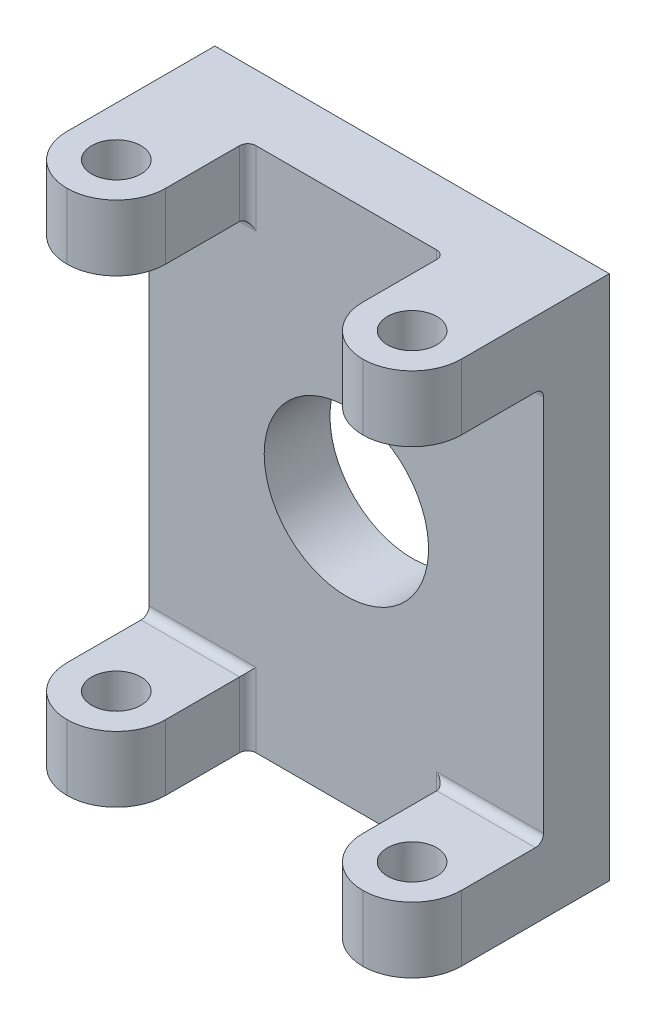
ISO-10303-21;
HEADER;
FILE_DESCRIPTION(('STEP AP214'),'2;1');
FILE_NAME('part.step','',(''),(''),'','','');
FILE_SCHEMA(('AUTOMOTIVE_DESIGN { 1 0 10303 214 1 1 1 1 }'));
ENDSEC;
DATA;
#1=APPLICATION_CONTEXT('core data for automotive mechanical design processes');
#2=APPLICATION_PROTOCOL_DEFINITION('international standard','automotive_design',2000,#1);
#3=PRODUCT_CONTEXT('',#1,'mechanical');
#4=PRODUCT('Part','Part','',(#3));
#5=PRODUCT_RELATED_PRODUCT_CATEGORY('part','',(#4));
#6=PRODUCT_DEFINITION_FORMATION('','',#4);
#7=PRODUCT_DEFINITION_CONTEXT('part definition',#1,'design');
#8=PRODUCT_DEFINITION('design','',#6,#7);
#9=PRODUCT_DEFINITION_SHAPE('','',#8);
#10=(LENGTH_UNIT() NAMED_UNIT(*) SI_UNIT(.MILLI.,.METRE.));
#11=(NAMED_UNIT(*) PLANE_ANGLE_UNIT() SI_UNIT($,.RADIAN.));
#12=(NAMED_UNIT(*) SI_UNIT($,.STERADIAN.) SOLID_ANGLE_UNIT());
#13=UNCERTAINTY_MEASURE_WITH_UNIT(LENGTH_MEASURE(1.E-05),#10,'distance_accuracy_value','');
#14=(GEOMETRIC_REPRESENTATION_CONTEXT(3) GLOBAL_UNCERTAINTY_ASSIGNED_CONTEXT((#13)) GLOBAL_UNIT_ASSIGNED_CONTEXT((#10,
#11,#12)) REPRESENTATION_CONTEXT('',''));
#15=CARTESIAN_POINT('',(0.,0.,0.));
#16=DIRECTION('',(0.,0.,1.));
#17=DIRECTION('',(1.,0.,0.));
#18=AXIS2_PLACEMENT_3D('',#15,#16,#17);
#19=CARTESIAN_POINT('',(-76.2,-101.6,25.4));
#20=DIRECTION('',(0.,0.,-1.));
#21=DIRECTION('',(-1.,0.,0.));
#22=AXIS2_PLACEMENT_3D('',#19,#20,#21);
#23=PLANE('',#22);
#24=CARTESIAN_POINT('',(0.,0.,25.4));
#25=DIRECTION('',(0.,0.,-1.));
#26=DIRECTION('',(-1.,0.,0.));
#27=AXIS2_PLACEMENT_3D('',#24,#25,#26);
#28=CIRCLE('',#27,31.75);
#29=CARTESIAN_POINT('',(-31.75,0.,25.4));
#30=VERTEX_POINT('',#29);
#31=EDGE_CURVE('E238',#30,#30,#28,.T.);
#32=ORIENTED_EDGE('',*,*,#31,.T.);
#33=EDGE_LOOP('',(#32));
#34=FACE_BOUND('',#33,.T.);
#35=DIRECTION('',(0.,1.,0.));
#36=VECTOR('',#35,1.);
#37=CARTESIAN_POINT('',(34.925,-101.6,25.4));
#38=LINE('',#37,#36);
#39=CARTESIAN_POINT('',(34.925,-101.6,25.4));
#40=VERTEX_POINT('',#39);
#41=CARTESIAN_POINT('',(34.925,-73.025,25.4));
#42=VERTEX_POINT('',#41);
#43=EDGE_CURVE('E367',#40,#42,#38,.T.);
#44=ORIENTED_EDGE('',*,*,#43,.T.);
#45=DIRECTION('',(1.,0.,0.));
#46=VECTOR('',#45,1.);
#47=CARTESIAN_POINT('',(-76.2,-73.025,25.4));
#48=LINE('',#47,#46);
#49=CARTESIAN_POINT('',(76.2,-73.025,25.4));
#50=VERTEX_POINT('',#49);
#51=EDGE_CURVE('E378',#42,#50,#48,.T.);
#52=ORIENTED_EDGE('',*,*,#51,.T.);
#53=DIRECTION('',(0.,1.,0.));
#54=VECTOR('',#53,1.);
#55=CARTESIAN_POINT('',(76.2,-101.6,25.4));
#56=LINE('',#55,#54);
#57=CARTESIAN_POINT('',(76.2,73.025,25.4));
#58=VERTEX_POINT('',#57);
#59=EDGE_CURVE('E358',#50,#58,#56,.T.);
#60=ORIENTED_EDGE('',*,*,#59,.T.);
#61=DIRECTION('',(1.,0.,0.));
#62=VECTOR('',#61,1.);
#63=CARTESIAN_POINT('',(38.1,73.025,25.4));
#64=LINE('',#63,#62);
#65=CARTESIAN_POINT('',(34.925,73.025,25.4));
#66=VERTEX_POINT('',#65);
#67=EDGE_CURVE('E379',#58,#66,#64,.F.);
#68=ORIENTED_EDGE('',*,*,#67,.T.);
#69=DIRECTION('',(0.,-1.,0.));
#70=VECTOR('',#69,1.);
#71=CARTESIAN_POINT('',(34.925,101.6,25.4));
#72=LINE('',#71,#70);
#73=CARTESIAN_POINT('',(34.925,101.6,25.4));
#74=VERTEX_POINT('',#73);
#75=EDGE_CURVE('E383',#66,#74,#72,.F.);
#76=ORIENTED_EDGE('',*,*,#75,.T.);
#77=DIRECTION('',(-1.,0.,0.));
#78=VECTOR('',#77,1.);
#79=CARTESIAN_POINT('',(-76.2,101.6,25.4));
#80=LINE('',#79,#78);
#81=CARTESIAN_POINT('',(-34.925,101.6,25.4));
#82=VERTEX_POINT('',#81);
#83=EDGE_CURVE('E244',#74,#82,#80,.T.);
#84=ORIENTED_EDGE('',*,*,#83,.T.);
#85=DIRECTION('',(0.,-1.,0.));
#86=VECTOR('',#85,1.);
#87=CARTESIAN_POINT('',(-34.925,-101.6,25.4));
#88=LINE('',#87,#86);
#89=CARTESIAN_POINT('',(-34.925,73.025,25.4));
#90=VERTEX_POINT('',#89);
#91=EDGE_CURVE('E433',#82,#90,#88,.T.);
#92=ORIENTED_EDGE('',*,*,#91,.T.);
#93=DIRECTION('',(-1.,0.,0.));
#94=VECTOR('',#93,1.);
#95=CARTESIAN_POINT('',(-76.2,73.025,25.4));
#96=LINE('',#95,#94);
#97=CARTESIAN_POINT('',(-76.2,73.025,25.4));
#98=VERTEX_POINT('',#97);
#99=EDGE_CURVE('E431',#90,#98,#96,.T.);
#100=ORIENTED_EDGE('',*,*,#99,.T.);
#101=DIRECTION('',(0.,-1.,0.));
#102=VECTOR('',#101,1.);
#103=CARTESIAN_POINT('',(-76.2,-101.6,25.4));
#104=LINE('',#103,#102);
#105=CARTESIAN_POINT('',(-76.2,-73.025,25.4));
#106=VERTEX_POINT('',#105);
#107=EDGE_CURVE('E250',#98,#106,#104,.T.);
#108=ORIENTED_EDGE('',*,*,#107,.T.);
#109=DIRECTION('',(-1.,0.,0.));
#110=VECTOR('',#109,1.);
#111=CARTESIAN_POINT('',(-38.1,-73.025,25.4));
#112=LINE('',#111,#110);
#113=CARTESIAN_POINT('',(-34.925,-73.025,25.4));
#114=VERTEX_POINT('',#113);
#115=EDGE_CURVE('E437',#106,#114,#112,.F.);
#116=ORIENTED_EDGE('',*,*,#115,.T.);
#117=DIRECTION('',(0.,1.,0.));
#118=VECTOR('',#117,1.);
#119=CARTESIAN_POINT('',(-34.925,-101.6,25.4));
#120=LINE('',#119,#118);
#121=CARTESIAN_POINT('',(-34.925,-101.6,25.4));
#122=VERTEX_POINT('',#121);
#123=EDGE_CURVE('E348',#114,#122,#120,.F.);
#124=ORIENTED_EDGE('',*,*,#123,.T.);
#125=DIRECTION('',(1.,0.,0.));
#126=VECTOR('',#125,1.);
#127=CARTESIAN_POINT('',(-76.2,-101.6,25.4));
#128=LINE('',#127,#126);
#129=EDGE_CURVE('E352',#122,#40,#128,.T.);
#130=ORIENTED_EDGE('',*,*,#129,.T.);
#131=EDGE_LOOP('',(#44,#52,#60,#68,#76,#84,#92,#100,#108,#116,#124,#130));
#132=FACE_BOUND('',#131,.T.);
#133=ADVANCED_FACE('F34',(#34,#132),#23,.F.);
#134=CARTESIAN_POINT('',(-76.2,101.6,25.4));
#135=DIRECTION('',(0.,-1.,0.));
#136=DIRECTION('',(1.,0.,0.));
#137=AXIS2_PLACEMENT_3D('',#134,#135,#136);
#138=PLANE('',#137);
#139=CARTESIAN_POINT('',(57.15,101.6,57.15));
#140=DIRECTION('',(0.,1.,0.));
#141=DIRECTION('',(-1.,0.,0.));
#142=AXIS2_PLACEMENT_3D('',#139,#140,#141);
#143=CIRCLE('',#142,9.525);
#144=CARTESIAN_POINT('',(47.625,101.6,57.15));
#145=VERTEX_POINT('',#144);
#146=EDGE_CURVE('E345',#145,#145,#143,.T.);
#147=ORIENTED_EDGE('',*,*,#146,.F.);
#148=EDGE_LOOP('',(#147));
#149=FACE_BOUND('',#148,.T.);
#150=DIRECTION('',(0.,0.,-1.));
#151=VECTOR('',#150,1.);
#152=CARTESIAN_POINT('',(38.1,101.6,76.2));
#153=LINE('',#152,#151);
#154=CARTESIAN_POINT('',(38.1,101.6,57.15));
#155=VERTEX_POINT('',#154);
#156=CARTESIAN_POINT('',(38.1,101.6,28.575));
#157=VERTEX_POINT('',#156);
#158=EDGE_CURVE('E727',#155,#157,#153,.T.);
#159=ORIENTED_EDGE('',*,*,#158,.F.);
#160=CARTESIAN_POINT('',(57.15,101.6,57.15));
#161=DIRECTION('',(0.,-1.,0.));
#162=DIRECTION('',(1.,0.,0.));
#163=AXIS2_PLACEMENT_3D('',#160,#161,#162);
#164=CIRCLE('',#163,19.05);
#165=CARTESIAN_POINT('',(57.15,101.6,76.2));
#166=VERTEX_POINT('',#165);
#167=EDGE_CURVE('E333',#155,#166,#164,.F.);
#168=ORIENTED_EDGE('',*,*,#167,.T.);
#169=CARTESIAN_POINT('',(57.15,101.6,57.15));
#170=DIRECTION('',(0.,-1.,0.));
#171=DIRECTION('',(1.,0.,0.));
#172=AXIS2_PLACEMENT_3D('',#169,#170,#171);
#173=CIRCLE('',#172,19.05);
#174=CARTESIAN_POINT('',(76.2,101.6,57.15));
#175=VERTEX_POINT('',#174);
#176=EDGE_CURVE('E331',#166,#175,#173,.F.);
#177=ORIENTED_EDGE('',*,*,#176,.T.);
#178=DIRECTION('',(0.,0.,-1.));
#179=VECTOR('',#178,1.);
#180=CARTESIAN_POINT('',(76.2,101.6,25.4));
#181=LINE('',#180,#179);
#182=CARTESIAN_POINT('',(76.2,101.6,0.));
#183=VERTEX_POINT('',#182);
#184=EDGE_CURVE('E252',#175,#183,#181,.T.);
#185=ORIENTED_EDGE('',*,*,#184,.T.);
#186=DIRECTION('',(-1.,0.,0.));
#187=VECTOR('',#186,1.);
#188=CARTESIAN_POINT('',(-76.2,101.6,0.));
#189=LINE('',#188,#187);
#190=CARTESIAN_POINT('',(-76.2,101.6,0.));
#191=VERTEX_POINT('',#190);
#192=EDGE_CURVE('E248',#183,#191,#189,.T.);
#193=ORIENTED_EDGE('',*,*,#192,.T.);
#194=DIRECTION('',(0.,0.,-1.));
#195=VECTOR('',#194,1.);
#196=CARTESIAN_POINT('',(-76.2,101.6,25.4));
#197=LINE('',#196,#195);
#198=CARTESIAN_POINT('',(-76.2,101.6,57.15));
#199=VERTEX_POINT('',#198);
#200=EDGE_CURVE('E236',#199,#191,#197,.T.);
#201=ORIENTED_EDGE('',*,*,#200,.F.);
#202=CARTESIAN_POINT('',(-57.15,101.6,57.15));
#203=DIRECTION('',(0.,-1.,0.));
#204=DIRECTION('',(1.,0.,0.));
#205=AXIS2_PLACEMENT_3D('',#202,#203,#204);
#206=CIRCLE('',#205,19.05);
#207=CARTESIAN_POINT('',(-57.15,101.6,76.2));
#208=VERTEX_POINT('',#207);
#209=EDGE_CURVE('E310',#199,#208,#206,.F.);
#210=ORIENTED_EDGE('',*,*,#209,.T.);
#211=CARTESIAN_POINT('',(-57.15,101.6,57.15));
#212=DIRECTION('',(0.,-1.,0.));
#213=DIRECTION('',(1.,0.,0.));
#214=AXIS2_PLACEMENT_3D('',#211,#212,#213);
#215=CIRCLE('',#214,19.05);
#216=CARTESIAN_POINT('',(-38.1,101.6,57.15));
#217=VERTEX_POINT('',#216);
#218=EDGE_CURVE('E312',#208,#217,#215,.F.);
#219=ORIENTED_EDGE('',*,*,#218,.T.);
#220=DIRECTION('',(0.,0.,-1.));
#221=VECTOR('',#220,1.);
#222=CARTESIAN_POINT('',(-38.1,101.6,76.2));
#223=LINE('',#222,#221);
#224=CARTESIAN_POINT('',(-38.1,101.6,28.575));
#225=VERTEX_POINT('',#224);
#226=EDGE_CURVE('E320',#217,#225,#223,.T.);
#227=ORIENTED_EDGE('',*,*,#226,.T.);
#228=CARTESIAN_POINT('',(-34.925,101.6,28.575));
#229=DIRECTION('',(0.,-1.,0.));
#230=DIRECTION('',(1.,0.,0.));
#231=AXIS2_PLACEMENT_3D('',#228,#229,#230);
#232=CIRCLE('',#231,3.175);
#233=EDGE_CURVE('E43',#225,#82,#232,.T.);
#234=ORIENTED_EDGE('',*,*,#233,.T.);
#235=ORIENTED_EDGE('',*,*,#83,.F.);
#236=CARTESIAN_POINT('',(34.925,101.6,28.575));
#237=DIRECTION('',(0.,-1.,0.));
#238=DIRECTION('',(1.,0.,0.));
#239=AXIS2_PLACEMENT_3D('',#236,#237,#238);
#240=CIRCLE('',#239,3.175);
#241=EDGE_CURVE('E409',#74,#157,#240,.T.);
#242=ORIENTED_EDGE('',*,*,#241,.T.);
#243=EDGE_LOOP('',(#159,#168,#177,#185,#193,#201,#210,#219,#227,#234,#235,#242));
#244=FACE_BOUND('',#243,.T.);
#245=CARTESIAN_POINT('',(-57.15,101.6,57.15));
#246=DIRECTION('',(0.,-1.,0.));
#247=DIRECTION('',(1.,0.,0.));
#248=AXIS2_PLACEMENT_3D('',#245,#246,#247);
#249=CIRCLE('',#248,9.525);
#250=CARTESIAN_POINT('',(-47.625,101.6,57.15));
#251=VERTEX_POINT('',#250);
#252=EDGE_CURVE('E324',#251,#251,#249,.T.);
#253=ORIENTED_EDGE('',*,*,#252,.T.);
#254=EDGE_LOOP('',(#253));
#255=FACE_BOUND('',#254,.T.);
#256=ADVANCED_FACE('F476',(#149,#244,#255),#138,.F.);
#257=CARTESIAN_POINT('',(-76.2,76.2,76.2));
#258=DIRECTION('',(0.,-1.,0.));
#259=DIRECTION('',(0.,0.,-1.));
#260=AXIS2_PLACEMENT_3D('',#257,#258,#259);
#261=PLANE('',#260);
#262=DIRECTION('',(0.,0.,-1.));
#263=VECTOR('',#262,1.);
#264=CARTESIAN_POINT('',(-76.2,76.2,76.2));
#265=LINE('',#264,#263);
#266=CARTESIAN_POINT('',(-76.2,76.2,57.15));
#267=VERTEX_POINT('',#266);
#268=CARTESIAN_POINT('',(-76.2,76.2,28.575));
#269=VERTEX_POINT('',#268);
#270=EDGE_CURVE('E718',#267,#269,#265,.T.);
#271=ORIENTED_EDGE('',*,*,#270,.T.);
#272=DIRECTION('',(-1.,0.,0.));
#273=VECTOR('',#272,1.);
#274=CARTESIAN_POINT('',(-76.2,76.2,28.575));
#275=LINE('',#274,#273);
#276=CARTESIAN_POINT('',(-38.1,76.2,28.575));
#277=VERTEX_POINT('',#276);
#278=EDGE_CURVE('E388',#269,#277,#275,.F.);
#279=ORIENTED_EDGE('',*,*,#278,.T.);
#280=DIRECTION('',(0.,0.,-1.));
#281=VECTOR('',#280,1.);
#282=CARTESIAN_POINT('',(-38.1,76.2,76.2));
#283=LINE('',#282,#281);
#284=CARTESIAN_POINT('',(-38.1,76.2,57.15));
#285=VERTEX_POINT('',#284);
#286=EDGE_CURVE('E720',#285,#277,#283,.T.);
#287=ORIENTED_EDGE('',*,*,#286,.F.);
#288=CARTESIAN_POINT('',(-57.15,76.2,57.15));
#289=DIRECTION('',(0.,-1.,0.));
#290=DIRECTION('',(0.,0.,-1.));
#291=AXIS2_PLACEMENT_3D('',#288,#289,#290);
#292=CIRCLE('',#291,19.05);
#293=CARTESIAN_POINT('',(-57.15,76.2,76.2));
#294=VERTEX_POINT('',#293);
#295=EDGE_CURVE('E308',#285,#294,#292,.T.);
#296=ORIENTED_EDGE('',*,*,#295,.T.);
#297=CARTESIAN_POINT('',(-57.15,76.2,57.15));
#298=DIRECTION('',(0.,-1.,0.));
#299=DIRECTION('',(0.,0.,-1.));
#300=AXIS2_PLACEMENT_3D('',#297,#298,#299);
#301=CIRCLE('',#300,19.05);
#302=EDGE_CURVE('E306',#294,#267,#301,.T.);
#303=ORIENTED_EDGE('',*,*,#302,.T.);
#304=EDGE_LOOP('',(#271,#279,#287,#296,#303));
#305=FACE_BOUND('',#304,.T.);
#306=CARTESIAN_POINT('',(-57.15,76.2,57.15));
#307=DIRECTION('',(0.,-1.,0.));
#308=DIRECTION('',(0.,0.,-1.));
#309=AXIS2_PLACEMENT_3D('',#306,#307,#308);
#310=CIRCLE('',#309,9.525);
#311=CARTESIAN_POINT('',(-57.15,76.2,47.625));
#312=VERTEX_POINT('',#311);
#313=EDGE_CURVE('E321',#312,#312,#310,.F.);
#314=ORIENTED_EDGE('',*,*,#313,.T.);
#315=EDGE_LOOP('',(#314));
#316=FACE_BOUND('',#315,.T.);
#317=ADVANCED_FACE('F482',(#305,#316),#261,.T.);
#318=CARTESIAN_POINT('',(-76.2,-101.6,25.4));
#319=DIRECTION('',(0.,1.,0.));
#320=DIRECTION('',(0.,0.,1.));
#321=AXIS2_PLACEMENT_3D('',#318,#319,#320);
#322=PLANE('',#321);
#323=CARTESIAN_POINT('',(57.15,-101.6,57.15));
#324=DIRECTION('',(0.,1.,0.));
#325=DIRECTION('',(0.,0.,1.));
#326=AXIS2_PLACEMENT_3D('',#323,#324,#325);
#327=CIRCLE('',#326,19.05);
#328=CARTESIAN_POINT('',(76.2,-101.6,57.15));
#329=VERTEX_POINT('',#328);
#330=CARTESIAN_POINT('',(57.15,-101.6,76.2));
#331=VERTEX_POINT('',#330);
#332=EDGE_CURVE('E289',#329,#331,#327,.F.);
#333=ORIENTED_EDGE('',*,*,#332,.T.);
#334=CARTESIAN_POINT('',(57.15,-101.6,57.15));
#335=DIRECTION('',(0.,1.,0.));
#336=DIRECTION('',(0.,0.,1.));
#337=AXIS2_PLACEMENT_3D('',#334,#335,#336);
#338=CIRCLE('',#337,19.05);
#339=CARTESIAN_POINT('',(38.1,-101.6,57.15));
#340=VERTEX_POINT('',#339);
#341=EDGE_CURVE('E291',#331,#340,#338,.F.);
#342=ORIENTED_EDGE('',*,*,#341,.T.);
#343=DIRECTION('',(0.,0.,-1.));
#344=VECTOR('',#343,1.);
#345=CARTESIAN_POINT('',(38.1,-101.6,76.2));
#346=LINE('',#345,#344);
#347=CARTESIAN_POINT('',(38.1,-101.6,28.575));
#348=VERTEX_POINT('',#347);
#349=EDGE_CURVE('E299',#340,#348,#346,.T.);
#350=ORIENTED_EDGE('',*,*,#349,.T.);
#351=CARTESIAN_POINT('',(34.925,-101.6,28.575));
#352=DIRECTION('',(0.,1.,0.));
#353=DIRECTION('',(0.,0.,1.));
#354=AXIS2_PLACEMENT_3D('',#351,#352,#353);
#355=CIRCLE('',#354,3.175);
#356=EDGE_CURVE('E374',#348,#40,#355,.T.);
#357=ORIENTED_EDGE('',*,*,#356,.T.);
#358=ORIENTED_EDGE('',*,*,#129,.F.);
#359=CARTESIAN_POINT('',(-34.925,-101.6,28.575));
#360=DIRECTION('',(0.,1.,0.));
#361=DIRECTION('',(0.,0.,1.));
#362=AXIS2_PLACEMENT_3D('',#359,#360,#361);
#363=CIRCLE('',#362,3.175);
#364=CARTESIAN_POINT('',(-38.1,-101.6,28.575));
#365=VERTEX_POINT('',#364);
#366=EDGE_CURVE('E11',#122,#365,#363,.T.);
#367=ORIENTED_EDGE('',*,*,#366,.T.);
#368=DIRECTION('',(0.,0.,-1.));
#369=VECTOR('',#368,1.);
#370=CARTESIAN_POINT('',(-38.1,-101.6,76.2));
#371=LINE('',#370,#369);
#372=CARTESIAN_POINT('',(-38.1,-101.6,57.15));
#373=VERTEX_POINT('',#372);
#374=EDGE_CURVE('E260',#373,#365,#371,.T.);
#375=ORIENTED_EDGE('',*,*,#374,.F.);
#376=CARTESIAN_POINT('',(-57.15,-101.6,57.15));
#377=DIRECTION('',(0.,1.,0.));
#378=DIRECTION('',(0.,0.,1.));
#379=AXIS2_PLACEMENT_3D('',#376,#377,#378);
#380=CIRCLE('',#379,19.05);
#381=CARTESIAN_POINT('',(-57.15,-101.6,76.2));
#382=VERTEX_POINT('',#381);
#383=EDGE_CURVE('E270',#373,#382,#380,.F.);
#384=ORIENTED_EDGE('',*,*,#383,.T.);
#385=CARTESIAN_POINT('',(-57.15,-101.6,57.15));
#386=DIRECTION('',(0.,1.,0.));
#387=DIRECTION('',(0.,0.,1.));
#388=AXIS2_PLACEMENT_3D('',#385,#386,#387);
#389=CIRCLE('',#388,19.05);
#390=CARTESIAN_POINT('',(-76.2,-101.6,57.15));
#391=VERTEX_POINT('',#390);
#392=EDGE_CURVE('E218',#382,#391,#389,.F.);
#393=ORIENTED_EDGE('',*,*,#392,.T.);
#394=DIRECTION('',(0.,0.,-1.));
#395=VECTOR('',#394,1.);
#396=CARTESIAN_POINT('',(-76.2,-101.6,25.4));
#397=LINE('',#396,#395);
#398=CARTESIAN_POINT('',(-76.2,-101.6,0.));
#399=VERTEX_POINT('',#398);
#400=EDGE_CURVE('E210',#391,#399,#397,.T.);
#401=ORIENTED_EDGE('',*,*,#400,.T.);
#402=DIRECTION('',(1.,0.,0.));
#403=VECTOR('',#402,1.);
#404=CARTESIAN_POINT('',(-76.2,-101.6,0.));
#405=LINE('',#404,#403);
#406=CARTESIAN_POINT('',(76.2,-101.6,0.));
#407=VERTEX_POINT('',#406);
#408=EDGE_CURVE('E215',#399,#407,#405,.T.);
#409=ORIENTED_EDGE('',*,*,#408,.T.);
#410=DIRECTION('',(0.,0.,-1.));
#411=VECTOR('',#410,1.);
#412=CARTESIAN_POINT('',(76.2,-101.6,25.4));
#413=LINE('',#412,#411);
#414=EDGE_CURVE('E223',#329,#407,#413,.T.);
#415=ORIENTED_EDGE('',*,*,#414,.F.);
#416=EDGE_LOOP('',(#333,#342,#350,#357,#358,#367,#375,#384,#393,#401,#409,#415));
#417=FACE_BOUND('',#416,.T.);
#418=CARTESIAN_POINT('',(-57.15,-101.6,57.15));
#419=DIRECTION('',(0.,-1.,0.));
#420=DIRECTION('',(1.,0.,0.));
#421=AXIS2_PLACEMENT_3D('',#418,#419,#420);
#422=CIRCLE('',#421,9.525);
#423=CARTESIAN_POINT('',(-47.625,-101.6,57.15));
#424=VERTEX_POINT('',#423);
#425=EDGE_CURVE('E282',#424,#424,#422,.T.);
#426=ORIENTED_EDGE('',*,*,#425,.F.);
#427=EDGE_LOOP('',(#426));
#428=FACE_BOUND('',#427,.T.);
#429=CARTESIAN_POINT('',(57.15,-101.6,57.15));
#430=DIRECTION('',(0.,1.,0.));
#431=DIRECTION('',(-1.,0.,0.));
#432=AXIS2_PLACEMENT_3D('',#429,#430,#431);
#433=CIRCLE('',#432,9.525);
#434=CARTESIAN_POINT('',(47.625,-101.6,57.15));
#435=VERTEX_POINT('',#434);
#436=EDGE_CURVE('E303',#435,#435,#433,.T.);
#437=ORIENTED_EDGE('',*,*,#436,.T.);
#438=EDGE_LOOP('',(#437));
#439=FACE_BOUND('',#438,.T.);
#440=ADVANCED_FACE('F212',(#417,#428,#439),#322,.F.);
#441=CARTESIAN_POINT('',(76.2,-76.2,76.2));
#442=DIRECTION('',(0.,1.,0.));
#443=DIRECTION('',(0.,0.,1.));
#444=AXIS2_PLACEMENT_3D('',#441,#442,#443);
#445=PLANE('',#444);
#446=DIRECTION('',(0.,0.,-1.));
#447=VECTOR('',#446,1.);
#448=CARTESIAN_POINT('',(76.2,-76.2,76.2));
#449=LINE('',#448,#447);
#450=CARTESIAN_POINT('',(76.2,-76.2,57.15));
#451=VERTEX_POINT('',#450);
#452=CARTESIAN_POINT('',(76.2,-76.2,28.575));
#453=VERTEX_POINT('',#452);
#454=EDGE_CURVE('E705',#451,#453,#449,.T.);
#455=ORIENTED_EDGE('',*,*,#454,.T.);
#456=DIRECTION('',(1.,0.,0.));
#457=VECTOR('',#456,1.);
#458=CARTESIAN_POINT('',(76.2,-76.2,28.575));
#459=LINE('',#458,#457);
#460=CARTESIAN_POINT('',(38.1,-76.2,28.575));
#461=VERTEX_POINT('',#460);
#462=EDGE_CURVE('E381',#453,#461,#459,.F.);
#463=ORIENTED_EDGE('',*,*,#462,.T.);
#464=DIRECTION('',(0.,0.,-1.));
#465=VECTOR('',#464,1.);
#466=CARTESIAN_POINT('',(38.1,-76.2,76.2));
#467=LINE('',#466,#465);
#468=CARTESIAN_POINT('',(38.1,-76.2,57.15));
#469=VERTEX_POINT('',#468);
#470=EDGE_CURVE('E703',#469,#461,#467,.T.);
#471=ORIENTED_EDGE('',*,*,#470,.F.);
#472=CARTESIAN_POINT('',(57.15,-76.2,57.15));
#473=DIRECTION('',(0.,1.,0.));
#474=DIRECTION('',(0.,0.,1.));
#475=AXIS2_PLACEMENT_3D('',#472,#473,#474);
#476=CIRCLE('',#475,19.05);
#477=CARTESIAN_POINT('',(57.15,-76.2,76.2));
#478=VERTEX_POINT('',#477);
#479=EDGE_CURVE('E287',#469,#478,#476,.T.);
#480=ORIENTED_EDGE('',*,*,#479,.T.);
#481=CARTESIAN_POINT('',(57.15,-76.2,57.15));
#482=DIRECTION('',(0.,1.,0.));
#483=DIRECTION('',(0.,0.,1.));
#484=AXIS2_PLACEMENT_3D('',#481,#482,#483);
#485=CIRCLE('',#484,19.05);
#486=EDGE_CURVE('E285',#478,#451,#485,.T.);
#487=ORIENTED_EDGE('',*,*,#486,.T.);
#488=EDGE_LOOP('',(#455,#463,#471,#480,#487));
#489=FACE_BOUND('',#488,.T.);
#490=CARTESIAN_POINT('',(57.15,-76.2,57.15));
#491=DIRECTION('',(0.,1.,0.));
#492=DIRECTION('',(0.,0.,1.));
#493=AXIS2_PLACEMENT_3D('',#490,#491,#492);
#494=CIRCLE('',#493,9.525);
#495=CARTESIAN_POINT('',(57.15,-76.2,66.675));
#496=VERTEX_POINT('',#495);
#497=EDGE_CURVE('E300',#496,#496,#494,.F.);
#498=ORIENTED_EDGE('',*,*,#497,.T.);
#499=EDGE_LOOP('',(#498));
#500=FACE_BOUND('',#499,.T.);
#501=ADVANCED_FACE('F498',(#489,#500),#445,.T.);
#502=CARTESIAN_POINT('',(-76.2,-101.6,25.4));
#503=DIRECTION('',(1.,0.,0.));
#504=DIRECTION('',(0.,1.,0.));
#505=AXIS2_PLACEMENT_3D('',#502,#503,#504);
#506=PLANE('',#505);
#507=ORIENTED_EDGE('',*,*,#270,.F.);
#508=DIRECTION('',(0.,1.,0.));
#509=VECTOR('',#508,1.);
#510=CARTESIAN_POINT('',(-76.2,-101.6,57.15));
#511=LINE('',#510,#509);
#512=EDGE_CURVE('E314',#267,#199,#511,.T.);
#513=ORIENTED_EDGE('',*,*,#512,.T.);
#514=ORIENTED_EDGE('',*,*,#200,.T.);
#515=DIRECTION('',(0.,-1.,0.));
#516=VECTOR('',#515,1.);
#517=CARTESIAN_POINT('',(-76.2,-101.6,0.));
#518=LINE('',#517,#516);
#519=EDGE_CURVE('E229',#191,#399,#518,.T.);
#520=ORIENTED_EDGE('',*,*,#519,.T.);
#521=ORIENTED_EDGE('',*,*,#400,.F.);
#522=DIRECTION('',(0.,-1.,0.));
#523=VECTOR('',#522,1.);
#524=CARTESIAN_POINT('',(-76.2,-101.6,57.15));
#525=LINE('',#524,#523);
#526=CARTESIAN_POINT('',(-76.2,-76.2,57.15));
#527=VERTEX_POINT('',#526);
#528=EDGE_CURVE('E272',#391,#527,#525,.F.);
#529=ORIENTED_EDGE('',*,*,#528,.T.);
#530=DIRECTION('',(0.,0.,-1.));
#531=VECTOR('',#530,1.);
#532=CARTESIAN_POINT('',(-76.2,-76.2,76.2));
#533=LINE('',#532,#531);
#534=CARTESIAN_POINT('',(-76.2,-76.2,28.575));
#535=VERTEX_POINT('',#534);
#536=EDGE_CURVE('E278',#527,#535,#533,.T.);
#537=ORIENTED_EDGE('',*,*,#536,.T.);
#538=CARTESIAN_POINT('',(-76.2,-73.025,28.575));
#539=DIRECTION('',(1.,0.,0.));
#540=DIRECTION('',(0.,1.,0.));
#541=AXIS2_PLACEMENT_3D('',#538,#539,#540);
#542=CIRCLE('',#541,3.175);
#543=EDGE_CURVE('E400',#535,#106,#542,.T.);
#544=ORIENTED_EDGE('',*,*,#543,.T.);
#545=ORIENTED_EDGE('',*,*,#107,.F.);
#546=CARTESIAN_POINT('',(-76.2,73.025,28.575));
#547=DIRECTION('',(1.,0.,0.));
#548=DIRECTION('',(0.,1.,0.));
#549=AXIS2_PLACEMENT_3D('',#546,#547,#548);
#550=CIRCLE('',#549,3.175);
#551=EDGE_CURVE('E404',#98,#269,#550,.T.);
#552=ORIENTED_EDGE('',*,*,#551,.T.);
#553=EDGE_LOOP('',(#507,#513,#514,#520,#521,#529,#537,#544,#545,#552));
#554=FACE_BOUND('',#553,.T.);
#555=ADVANCED_FACE('F234',(#554),#506,.F.);
#556=CARTESIAN_POINT('',(76.2,-101.6,25.4));
#557=DIRECTION('',(-1.,0.,0.));
#558=DIRECTION('',(0.,0.,1.));
#559=AXIS2_PLACEMENT_3D('',#556,#557,#558);
#560=PLANE('',#559);
#561=ORIENTED_EDGE('',*,*,#184,.F.);
#562=DIRECTION('',(0.,1.,0.));
#563=VECTOR('',#562,1.);
#564=CARTESIAN_POINT('',(76.2,-101.6,57.15));
#565=LINE('',#564,#563);
#566=CARTESIAN_POINT('',(76.2,76.2,57.15));
#567=VERTEX_POINT('',#566);
#568=EDGE_CURVE('E335',#175,#567,#565,.F.);
#569=ORIENTED_EDGE('',*,*,#568,.T.);
#570=DIRECTION('',(0.,0.,-1.));
#571=VECTOR('',#570,1.);
#572=CARTESIAN_POINT('',(76.2,76.2,76.2));
#573=LINE('',#572,#571);
#574=CARTESIAN_POINT('',(76.2,76.2,28.575));
#575=VERTEX_POINT('',#574);
#576=EDGE_CURVE('E341',#567,#575,#573,.T.);
#577=ORIENTED_EDGE('',*,*,#576,.T.);
#578=CARTESIAN_POINT('',(76.2,73.025,28.575));
#579=DIRECTION('',(-1.,0.,0.));
#580=DIRECTION('',(0.,0.,1.));
#581=AXIS2_PLACEMENT_3D('',#578,#579,#580);
#582=CIRCLE('',#581,3.175);
#583=EDGE_CURVE('E406',#575,#58,#582,.T.);
#584=ORIENTED_EDGE('',*,*,#583,.T.);
#585=ORIENTED_EDGE('',*,*,#59,.F.);
#586=CARTESIAN_POINT('',(76.2,-73.025,28.575));
#587=DIRECTION('',(-1.,0.,0.));
#588=DIRECTION('',(0.,0.,1.));
#589=AXIS2_PLACEMENT_3D('',#586,#587,#588);
#590=CIRCLE('',#589,3.175);
#591=EDGE_CURVE('E402',#50,#453,#590,.T.);
#592=ORIENTED_EDGE('',*,*,#591,.T.);
#593=ORIENTED_EDGE('',*,*,#454,.F.);
#594=DIRECTION('',(0.,-1.,0.));
#595=VECTOR('',#594,1.);
#596=CARTESIAN_POINT('',(76.2,-101.6,57.15));
#597=LINE('',#596,#595);
#598=EDGE_CURVE('E293',#451,#329,#597,.T.);
#599=ORIENTED_EDGE('',*,*,#598,.T.);
#600=ORIENTED_EDGE('',*,*,#414,.T.);
#601=DIRECTION('',(0.,1.,0.));
#602=VECTOR('',#601,1.);
#603=CARTESIAN_POINT('',(76.2,-101.6,0.));
#604=LINE('',#603,#602);
#605=EDGE_CURVE('E231',#407,#183,#604,.T.);
#606=ORIENTED_EDGE('',*,*,#605,.T.);
#607=EDGE_LOOP('',(#561,#569,#577,#584,#585,#592,#593,#599,#600,#606));
#608=FACE_BOUND('',#607,.T.);
#609=ADVANCED_FACE('F490',(#608),#560,.F.);
#610=CARTESIAN_POINT('',(-76.2,-101.6,0.));
#611=DIRECTION('',(0.,0.,-1.));
#612=DIRECTION('',(-1.,0.,0.));
#613=AXIS2_PLACEMENT_3D('',#610,#611,#612);
#614=PLANE('',#613);
#615=CARTESIAN_POINT('',(0.,0.,0.));
#616=DIRECTION('',(0.,0.,-1.));
#617=DIRECTION('',(-1.,0.,0.));
#618=AXIS2_PLACEMENT_3D('',#615,#616,#617);
#619=CIRCLE('',#618,31.75);
#620=CARTESIAN_POINT('',(-31.75,0.,0.));
#621=VERTEX_POINT('',#620);
#622=EDGE_CURVE('E241',#621,#621,#619,.T.);
#623=ORIENTED_EDGE('',*,*,#622,.F.);
#624=EDGE_LOOP('',(#623));
#625=FACE_BOUND('',#624,.T.);
#626=ORIENTED_EDGE('',*,*,#519,.F.);
#627=ORIENTED_EDGE('',*,*,#192,.F.);
#628=ORIENTED_EDGE('',*,*,#605,.F.);
#629=ORIENTED_EDGE('',*,*,#408,.F.);
#630=EDGE_LOOP('',(#626,#627,#628,#629));
#631=FACE_BOUND('',#630,.T.);
#632=ADVANCED_FACE('F227',(#625,#631),#614,.T.);
#633=CARTESIAN_POINT('',(0.,0.,25.4));
#634=DIRECTION('',(0.,0.,-1.));
#635=DIRECTION('',(-1.,0.,0.));
#636=AXIS2_PLACEMENT_3D('',#633,#634,#635);
#637=CYLINDRICAL_SURFACE('',#636,31.75);
#638=ORIENTED_EDGE('',*,*,#31,.F.);
#639=EDGE_LOOP('',(#638));
#640=FACE_BOUND('',#639,.T.);
#641=ORIENTED_EDGE('',*,*,#622,.T.);
#642=EDGE_LOOP('',(#641));
#643=FACE_BOUND('',#642,.T.);
#644=ADVANCED_FACE('F487',(#640,#643),#637,.F.);
#645=CARTESIAN_POINT('',(-38.1,-101.6,76.2));
#646=DIRECTION('',(-1.,0.,0.));
#647=DIRECTION('',(0.,0.,1.));
#648=AXIS2_PLACEMENT_3D('',#645,#646,#647);
#649=PLANE('',#648);
#650=ORIENTED_EDGE('',*,*,#374,.T.);
#651=DIRECTION('',(0.,1.,0.));
#652=VECTOR('',#651,1.);
#653=CARTESIAN_POINT('',(-38.1,-76.2,28.575));
#654=LINE('',#653,#652);
#655=CARTESIAN_POINT('',(-38.1,-76.2,28.575));
#656=VERTEX_POINT('',#655);
#657=EDGE_CURVE('E398',#365,#656,#654,.T.);
#658=ORIENTED_EDGE('',*,*,#657,.T.);
#659=DIRECTION('',(0.,0.,-1.));
#660=VECTOR('',#659,1.);
#661=CARTESIAN_POINT('',(-38.1,-76.2,76.2));
#662=LINE('',#661,#660);
#663=CARTESIAN_POINT('',(-38.1,-76.2,57.15));
#664=VERTEX_POINT('',#663);
#665=EDGE_CURVE('E263',#664,#656,#662,.T.);
#666=ORIENTED_EDGE('',*,*,#665,.F.);
#667=DIRECTION('',(0.,1.,0.));
#668=VECTOR('',#667,1.);
#669=CARTESIAN_POINT('',(-38.1,-101.6,57.15));
#670=LINE('',#669,#668);
#671=EDGE_CURVE('E266',#664,#373,#670,.F.);
#672=ORIENTED_EDGE('',*,*,#671,.T.);
#673=EDGE_LOOP('',(#650,#658,#666,#672));
#674=FACE_BOUND('',#673,.T.);
#675=ADVANCED_FACE('F460',(#674),#649,.F.);
#676=CARTESIAN_POINT('',(-76.2,-76.2,76.2));
#677=DIRECTION('',(0.,-1.,0.));
#678=DIRECTION('',(0.,0.,-1.));
#679=AXIS2_PLACEMENT_3D('',#676,#677,#678);
#680=PLANE('',#679);
#681=CARTESIAN_POINT('',(-57.15,-76.2,57.15));
#682=DIRECTION('',(0.,-1.,0.));
#683=DIRECTION('',(0.,0.,-1.));
#684=AXIS2_PLACEMENT_3D('',#681,#682,#683);
#685=CIRCLE('',#684,9.525);
#686=CARTESIAN_POINT('',(-57.15,-76.2,47.625));
#687=VERTEX_POINT('',#686);
#688=EDGE_CURVE('E279',#687,#687,#685,.T.);
#689=ORIENTED_EDGE('',*,*,#688,.T.);
#690=EDGE_LOOP('',(#689));
#691=FACE_BOUND('',#690,.T.);
#692=ORIENTED_EDGE('',*,*,#665,.T.);
#693=DIRECTION('',(-1.,0.,0.));
#694=VECTOR('',#693,1.);
#695=CARTESIAN_POINT('',(-76.2,-76.2,28.575));
#696=LINE('',#695,#694);
#697=EDGE_CURVE('E337',#656,#535,#696,.T.);
#698=ORIENTED_EDGE('',*,*,#697,.T.);
#699=ORIENTED_EDGE('',*,*,#536,.F.);
#700=CARTESIAN_POINT('',(-57.15,-76.2,57.15));
#701=DIRECTION('',(0.,-1.,0.));
#702=DIRECTION('',(0.,0.,-1.));
#703=AXIS2_PLACEMENT_3D('',#700,#701,#702);
#704=CIRCLE('',#703,19.05);
#705=CARTESIAN_POINT('',(-57.15,-76.2,76.2));
#706=VERTEX_POINT('',#705);
#707=EDGE_CURVE('E222',#527,#706,#704,.F.);
#708=ORIENTED_EDGE('',*,*,#707,.T.);
#709=CARTESIAN_POINT('',(-57.15,-76.2,57.15));
#710=DIRECTION('',(0.,-1.,0.));
#711=DIRECTION('',(0.,0.,-1.));
#712=AXIS2_PLACEMENT_3D('',#709,#710,#711);
#713=CIRCLE('',#712,19.05);
#714=EDGE_CURVE('E264',#706,#664,#713,.F.);
#715=ORIENTED_EDGE('',*,*,#714,.T.);
#716=EDGE_LOOP('',(#692,#698,#699,#708,#715));
#717=FACE_BOUND('',#716,.T.);
#718=ADVANCED_FACE('F451',(#691,#717),#680,.F.);
#719=CARTESIAN_POINT('',(-57.15,-76.2,57.15));
#720=DIRECTION('',(0.,-1.,0.));
#721=DIRECTION('',(1.,0.,0.));
#722=AXIS2_PLACEMENT_3D('',#719,#720,#721);
#723=CYLINDRICAL_SURFACE('',#722,19.05);
#724=ORIENTED_EDGE('',*,*,#528,.F.);
#725=ORIENTED_EDGE('',*,*,#392,.F.);
#726=DIRECTION('',(0.,-1.,0.));
#727=VECTOR('',#726,1.);
#728=CARTESIAN_POINT('',(-57.15,-76.2,76.2));
#729=LINE('',#728,#727);
#730=EDGE_CURVE('E275',#706,#382,#729,.T.);
#731=ORIENTED_EDGE('',*,*,#730,.F.);
#732=ORIENTED_EDGE('',*,*,#707,.F.);
#733=EDGE_LOOP('',(#724,#725,#731,#732));
#734=FACE_BOUND('',#733,.T.);
#735=ADVANCED_FACE('F463',(#734),#723,.T.);
#736=CARTESIAN_POINT('',(-57.15,-76.2,57.15));
#737=DIRECTION('',(0.,1.,0.));
#738=DIRECTION('',(0.,0.,1.));
#739=AXIS2_PLACEMENT_3D('',#736,#737,#738);
#740=CYLINDRICAL_SURFACE('',#739,19.05);
#741=ORIENTED_EDGE('',*,*,#383,.F.);
#742=ORIENTED_EDGE('',*,*,#671,.F.);
#743=ORIENTED_EDGE('',*,*,#714,.F.);
#744=ORIENTED_EDGE('',*,*,#730,.T.);
#745=EDGE_LOOP('',(#741,#742,#743,#744));
#746=FACE_BOUND('',#745,.T.);
#747=ADVANCED_FACE('F461',(#746),#740,.T.);
#748=CARTESIAN_POINT('',(-57.15,101.600025,57.15));
#749=DIRECTION('',(0.,-1.,0.));
#750=DIRECTION('',(1.,0.,0.));
#751=AXIS2_PLACEMENT_3D('',#748,#749,#750);
#752=CYLINDRICAL_SURFACE('',#751,9.525);
#753=ORIENTED_EDGE('',*,*,#425,.T.);
#754=EDGE_LOOP('',(#753));
#755=FACE_BOUND('',#754,.T.);
#756=ORIENTED_EDGE('',*,*,#688,.F.);
#757=EDGE_LOOP('',(#756));
#758=FACE_BOUND('',#757,.T.);
#759=ADVANCED_FACE('F470',(#755,#758),#752,.F.);
#760=CARTESIAN_POINT('',(38.1,-101.6,76.2));
#761=DIRECTION('',(-1.,0.,0.));
#762=DIRECTION('',(0.,0.,1.));
#763=AXIS2_PLACEMENT_3D('',#760,#761,#762);
#764=PLANE('',#763);
#765=ORIENTED_EDGE('',*,*,#470,.T.);
#766=DIRECTION('',(0.,1.,0.));
#767=VECTOR('',#766,1.);
#768=CARTESIAN_POINT('',(38.1,-101.6,28.575));
#769=LINE('',#768,#767);
#770=EDGE_CURVE('E393',#461,#348,#769,.F.);
#771=ORIENTED_EDGE('',*,*,#770,.T.);
#772=ORIENTED_EDGE('',*,*,#349,.F.);
#773=DIRECTION('',(0.,1.,0.));
#774=VECTOR('',#773,1.);
#775=CARTESIAN_POINT('',(38.1,-76.2,57.15));
#776=LINE('',#775,#774);
#777=EDGE_CURVE('E274',#340,#469,#776,.T.);
#778=ORIENTED_EDGE('',*,*,#777,.T.);
#779=EDGE_LOOP('',(#765,#771,#772,#778));
#780=FACE_BOUND('',#779,.T.);
#781=ADVANCED_FACE('F511',(#780),#764,.T.);
#782=CARTESIAN_POINT('',(57.15,-101.6,57.15));
#783=DIRECTION('',(0.,-1.,0.));
#784=DIRECTION('',(0.,0.,-1.));
#785=AXIS2_PLACEMENT_3D('',#782,#783,#784);
#786=CYLINDRICAL_SURFACE('',#785,19.05);
#787=DIRECTION('',(0.,-1.,0.));
#788=VECTOR('',#787,1.);
#789=CARTESIAN_POINT('',(57.15,-76.2,76.2));
#790=LINE('',#789,#788);
#791=EDGE_CURVE('E296',#331,#478,#790,.F.);
#792=ORIENTED_EDGE('',*,*,#791,.F.);
#793=ORIENTED_EDGE('',*,*,#332,.F.);
#794=ORIENTED_EDGE('',*,*,#598,.F.);
#795=ORIENTED_EDGE('',*,*,#486,.F.);
#796=EDGE_LOOP('',(#792,#793,#794,#795));
#797=FACE_BOUND('',#796,.T.);
#798=ADVANCED_FACE('F561',(#797),#786,.T.);
#799=CARTESIAN_POINT('',(57.15,-101.6,57.15));
#800=DIRECTION('',(0.,-1.,0.));
#801=DIRECTION('',(0.,0.,-1.));
#802=AXIS2_PLACEMENT_3D('',#799,#800,#801);
#803=CYLINDRICAL_SURFACE('',#802,19.05);
#804=ORIENTED_EDGE('',*,*,#341,.F.);
#805=ORIENTED_EDGE('',*,*,#791,.T.);
#806=ORIENTED_EDGE('',*,*,#479,.F.);
#807=ORIENTED_EDGE('',*,*,#777,.F.);
#808=EDGE_LOOP('',(#804,#805,#806,#807));
#809=FACE_BOUND('',#808,.T.);
#810=ADVANCED_FACE('F688',(#809),#803,.T.);
#811=CARTESIAN_POINT('',(57.15,101.600025,57.15));
#812=DIRECTION('',(0.,-1.,0.));
#813=DIRECTION('',(1.,0.,0.));
#814=AXIS2_PLACEMENT_3D('',#811,#812,#813);
#815=CYLINDRICAL_SURFACE('',#814,9.525);
#816=ORIENTED_EDGE('',*,*,#497,.F.);
#817=EDGE_LOOP('',(#816));
#818=FACE_BOUND('',#817,.T.);
#819=ORIENTED_EDGE('',*,*,#436,.F.);
#820=EDGE_LOOP('',(#819));
#821=FACE_BOUND('',#820,.T.);
#822=ADVANCED_FACE('F574',(#818,#821),#815,.F.);
#823=CARTESIAN_POINT('',(-38.1,101.6,76.2));
#824=DIRECTION('',(1.,0.,0.));
#825=DIRECTION('',(0.,0.,-1.));
#826=AXIS2_PLACEMENT_3D('',#823,#824,#825);
#827=PLANE('',#826);
#828=ORIENTED_EDGE('',*,*,#286,.T.);
#829=DIRECTION('',(0.,-1.,0.));
#830=VECTOR('',#829,1.);
#831=CARTESIAN_POINT('',(-38.1,101.6,28.575));
#832=LINE('',#831,#830);
#833=EDGE_CURVE('E57',#277,#225,#832,.F.);
#834=ORIENTED_EDGE('',*,*,#833,.T.);
#835=ORIENTED_EDGE('',*,*,#226,.F.);
#836=DIRECTION('',(0.,-1.,0.));
#837=VECTOR('',#836,1.);
#838=CARTESIAN_POINT('',(-38.1,76.2,57.15));
#839=LINE('',#838,#837);
#840=EDGE_CURVE('E295',#217,#285,#839,.T.);
#841=ORIENTED_EDGE('',*,*,#840,.T.);
#842=EDGE_LOOP('',(#828,#834,#835,#841));
#843=FACE_BOUND('',#842,.T.);
#844=ADVANCED_FACE('F568',(#843),#827,.T.);
#845=CARTESIAN_POINT('',(-57.15,-101.6,57.15));
#846=DIRECTION('',(0.,1.,0.));
#847=DIRECTION('',(-1.,0.,0.));
#848=AXIS2_PLACEMENT_3D('',#845,#846,#847);
#849=CYLINDRICAL_SURFACE('',#848,19.05);
#850=DIRECTION('',(0.,1.,0.));
#851=VECTOR('',#850,1.);
#852=CARTESIAN_POINT('',(-57.15,76.2,76.2));
#853=LINE('',#852,#851);
#854=EDGE_CURVE('E317',#208,#294,#853,.F.);
#855=ORIENTED_EDGE('',*,*,#854,.F.);
#856=ORIENTED_EDGE('',*,*,#209,.F.);
#857=ORIENTED_EDGE('',*,*,#512,.F.);
#858=ORIENTED_EDGE('',*,*,#302,.F.);
#859=EDGE_LOOP('',(#855,#856,#857,#858));
#860=FACE_BOUND('',#859,.T.);
#861=ADVANCED_FACE('F573',(#860),#849,.T.);
#862=CARTESIAN_POINT('',(-57.15,101.6,57.15));
#863=DIRECTION('',(0.,1.,0.));
#864=DIRECTION('',(0.,0.,1.));
#865=AXIS2_PLACEMENT_3D('',#862,#863,#864);
#866=CYLINDRICAL_SURFACE('',#865,19.05);
#867=ORIENTED_EDGE('',*,*,#218,.F.);
#868=ORIENTED_EDGE('',*,*,#854,.T.);
#869=ORIENTED_EDGE('',*,*,#295,.F.);
#870=ORIENTED_EDGE('',*,*,#840,.F.);
#871=EDGE_LOOP('',(#867,#868,#869,#870));
#872=FACE_BOUND('',#871,.T.);
#873=ADVANCED_FACE('F683',(#872),#866,.T.);
#874=CARTESIAN_POINT('',(-57.15,-101.60005,57.15));
#875=DIRECTION('',(0.,1.,0.));
#876=DIRECTION('',(-1.,0.,0.));
#877=AXIS2_PLACEMENT_3D('',#874,#875,#876);
#878=CYLINDRICAL_SURFACE('',#877,9.525);
#879=ORIENTED_EDGE('',*,*,#313,.F.);
#880=EDGE_LOOP('',(#879));
#881=FACE_BOUND('',#880,.T.);
#882=ORIENTED_EDGE('',*,*,#252,.F.);
#883=EDGE_LOOP('',(#882));
#884=FACE_BOUND('',#883,.T.);
#885=ADVANCED_FACE('F587',(#881,#884),#878,.F.);
#886=CARTESIAN_POINT('',(38.1,101.6,76.2));
#887=DIRECTION('',(1.,0.,0.));
#888=DIRECTION('',(0.,0.,-1.));
#889=AXIS2_PLACEMENT_3D('',#886,#887,#888);
#890=PLANE('',#889);
#891=ORIENTED_EDGE('',*,*,#158,.T.);
#892=DIRECTION('',(0.,-1.,0.));
#893=VECTOR('',#892,1.);
#894=CARTESIAN_POINT('',(38.1,76.2,28.575));
#895=LINE('',#894,#893);
#896=CARTESIAN_POINT('',(38.1,76.2,28.575));
#897=VERTEX_POINT('',#896);
#898=EDGE_CURVE('E395',#157,#897,#895,.T.);
#899=ORIENTED_EDGE('',*,*,#898,.T.);
#900=DIRECTION('',(0.,0.,-1.));
#901=VECTOR('',#900,1.);
#902=CARTESIAN_POINT('',(38.1,76.2,76.2));
#903=LINE('',#902,#901);
#904=CARTESIAN_POINT('',(38.1,76.2,57.15));
#905=VERTEX_POINT('',#904);
#906=EDGE_CURVE('E730',#905,#897,#903,.T.);
#907=ORIENTED_EDGE('',*,*,#906,.F.);
#908=DIRECTION('',(0.,-1.,0.));
#909=VECTOR('',#908,1.);
#910=CARTESIAN_POINT('',(38.1,101.6,57.15));
#911=LINE('',#910,#909);
#912=EDGE_CURVE('E328',#905,#155,#911,.F.);
#913=ORIENTED_EDGE('',*,*,#912,.T.);
#914=EDGE_LOOP('',(#891,#899,#907,#913));
#915=FACE_BOUND('',#914,.T.);
#916=ADVANCED_FACE('F582',(#915),#890,.F.);
#917=CARTESIAN_POINT('',(76.2,76.2,76.2));
#918=DIRECTION('',(0.,1.,0.));
#919=DIRECTION('',(0.,0.,1.));
#920=AXIS2_PLACEMENT_3D('',#917,#918,#919);
#921=PLANE('',#920);
#922=CARTESIAN_POINT('',(57.15,76.2,57.15));
#923=DIRECTION('',(0.,1.,0.));
#924=DIRECTION('',(0.,0.,1.));
#925=AXIS2_PLACEMENT_3D('',#922,#923,#924);
#926=CIRCLE('',#925,9.525);
#927=CARTESIAN_POINT('',(57.15,76.2,66.675));
#928=VERTEX_POINT('',#927);
#929=EDGE_CURVE('E342',#928,#928,#926,.T.);
#930=ORIENTED_EDGE('',*,*,#929,.T.);
#931=EDGE_LOOP('',(#930));
#932=FACE_BOUND('',#931,.T.);
#933=ORIENTED_EDGE('',*,*,#906,.T.);
#934=DIRECTION('',(1.,0.,0.));
#935=VECTOR('',#934,1.);
#936=CARTESIAN_POINT('',(76.2,76.2,28.575));
#937=LINE('',#936,#935);
#938=EDGE_CURVE('E390',#897,#575,#937,.T.);
#939=ORIENTED_EDGE('',*,*,#938,.T.);
#940=ORIENTED_EDGE('',*,*,#576,.F.);
#941=CARTESIAN_POINT('',(57.15,76.2,57.15));
#942=DIRECTION('',(0.,1.,0.));
#943=DIRECTION('',(0.,0.,1.));
#944=AXIS2_PLACEMENT_3D('',#941,#942,#943);
#945=CIRCLE('',#944,19.05);
#946=CARTESIAN_POINT('',(57.15,76.2,76.2));
#947=VERTEX_POINT('',#946);
#948=EDGE_CURVE('E316',#567,#947,#945,.F.);
#949=ORIENTED_EDGE('',*,*,#948,.T.);
#950=CARTESIAN_POINT('',(57.15,76.2,57.15));
#951=DIRECTION('',(0.,1.,0.));
#952=DIRECTION('',(0.,0.,1.));
#953=AXIS2_PLACEMENT_3D('',#950,#951,#952);
#954=CIRCLE('',#953,19.05);
#955=EDGE_CURVE('E326',#947,#905,#954,.F.);
#956=ORIENTED_EDGE('',*,*,#955,.T.);
#957=EDGE_LOOP('',(#933,#939,#940,#949,#956));
#958=FACE_BOUND('',#957,.T.);
#959=ADVANCED_FACE('F586',(#932,#958),#921,.F.);
#960=CARTESIAN_POINT('',(57.15,76.2,57.15));
#961=DIRECTION('',(0.,1.,0.));
#962=DIRECTION('',(0.,0.,1.));
#963=AXIS2_PLACEMENT_3D('',#960,#961,#962);
#964=CYLINDRICAL_SURFACE('',#963,19.05);
#965=ORIENTED_EDGE('',*,*,#568,.F.);
#966=ORIENTED_EDGE('',*,*,#176,.F.);
#967=DIRECTION('',(0.,1.,0.));
#968=VECTOR('',#967,1.);
#969=CARTESIAN_POINT('',(57.15,76.2,76.2));
#970=LINE('',#969,#968);
#971=EDGE_CURVE('E338',#947,#166,#970,.T.);
#972=ORIENTED_EDGE('',*,*,#971,.F.);
#973=ORIENTED_EDGE('',*,*,#948,.F.);
#974=EDGE_LOOP('',(#965,#966,#972,#973));
#975=FACE_BOUND('',#974,.T.);
#976=ADVANCED_FACE('F598',(#975),#964,.T.);
#977=CARTESIAN_POINT('',(57.15,76.2,57.15));
#978=DIRECTION('',(0.,-1.,0.));
#979=DIRECTION('',(0.,0.,-1.));
#980=AXIS2_PLACEMENT_3D('',#977,#978,#979);
#981=CYLINDRICAL_SURFACE('',#980,19.05);
#982=ORIENTED_EDGE('',*,*,#167,.F.);
#983=ORIENTED_EDGE('',*,*,#912,.F.);
#984=ORIENTED_EDGE('',*,*,#955,.F.);
#985=ORIENTED_EDGE('',*,*,#971,.T.);
#986=EDGE_LOOP('',(#982,#983,#984,#985));
#987=FACE_BOUND('',#986,.T.);
#988=ADVANCED_FACE('F677',(#987),#981,.T.);
#989=CARTESIAN_POINT('',(57.15,-101.60005,57.15));
#990=DIRECTION('',(0.,1.,0.));
#991=DIRECTION('',(-1.,0.,0.));
#992=AXIS2_PLACEMENT_3D('',#989,#990,#991);
#993=CYLINDRICAL_SURFACE('',#992,9.525);
#994=ORIENTED_EDGE('',*,*,#146,.T.);
#995=EDGE_LOOP('',(#994));
#996=FACE_BOUND('',#995,.T.);
#997=ORIENTED_EDGE('',*,*,#929,.F.);
#998=EDGE_LOOP('',(#997));
#999=FACE_BOUND('',#998,.T.);
#1000=ADVANCED_FACE('F610',(#996,#999),#993,.F.);
#1001=CARTESIAN_POINT('',(-34.925,-101.6,28.575));
#1002=DIRECTION('',(0.,-1.,0.));
#1003=DIRECTION('',(0.,0.,-1.));
#1004=AXIS2_PLACEMENT_3D('',#1001,#1002,#1003);
#1005=CYLINDRICAL_SURFACE('',#1004,3.175);
#1006=ORIENTED_EDGE('',*,*,#366,.F.);
#1007=ORIENTED_EDGE('',*,*,#123,.F.);
#1008=CARTESIAN_POINT('',(-34.925,-73.025,28.575));
#1009=DIRECTION('',(0.707106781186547,-0.707106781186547,0.));
#1010=DIRECTION('',(-0.707106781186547,-0.707106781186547,0.));
#1011=AXIS2_PLACEMENT_3D('',#1008,#1009,#1010);
#1012=ELLIPSE('',#1011,4.49012806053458,3.175);
#1013=EDGE_CURVE('E412',#656,#114,#1012,.T.);
#1014=ORIENTED_EDGE('',*,*,#1013,.F.);
#1015=ORIENTED_EDGE('',*,*,#657,.F.);
#1016=EDGE_LOOP('',(#1006,#1007,#1014,#1015));
#1017=FACE_BOUND('',#1016,.T.);
#1018=ADVANCED_FACE('F443',(#1017),#1005,.F.);
#1019=CARTESIAN_POINT('',(-76.2,-73.025,28.575));
#1020=DIRECTION('',(1.,0.,0.));
#1021=DIRECTION('',(0.,0.,-1.));
#1022=AXIS2_PLACEMENT_3D('',#1019,#1020,#1021);
#1023=CYLINDRICAL_SURFACE('',#1022,3.175);
#1024=ORIENTED_EDGE('',*,*,#1013,.T.);
#1025=ORIENTED_EDGE('',*,*,#115,.F.);
#1026=ORIENTED_EDGE('',*,*,#543,.F.);
#1027=ORIENTED_EDGE('',*,*,#697,.F.);
#1028=EDGE_LOOP('',(#1024,#1025,#1026,#1027));
#1029=FACE_BOUND('',#1028,.T.);
#1030=ADVANCED_FACE('F446',(#1029),#1023,.F.);
#1031=CARTESIAN_POINT('',(34.925,-101.6,28.575));
#1032=DIRECTION('',(0.,1.,0.));
#1033=DIRECTION('',(0.,0.,1.));
#1034=AXIS2_PLACEMENT_3D('',#1031,#1032,#1033);
#1035=CYLINDRICAL_SURFACE('',#1034,3.175);
#1036=ORIENTED_EDGE('',*,*,#356,.F.);
#1037=ORIENTED_EDGE('',*,*,#770,.F.);
#1038=CARTESIAN_POINT('',(34.925,-73.025,28.575));
#1039=DIRECTION('',(0.707106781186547,0.707106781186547,0.));
#1040=DIRECTION('',(-0.707106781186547,0.707106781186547,0.));
#1041=AXIS2_PLACEMENT_3D('',#1038,#1039,#1040);
#1042=ELLIPSE('',#1041,4.49012806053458,3.175);
#1043=EDGE_CURVE('E376',#42,#461,#1042,.F.);
#1044=ORIENTED_EDGE('',*,*,#1043,.F.);
#1045=ORIENTED_EDGE('',*,*,#43,.F.);
#1046=EDGE_LOOP('',(#1036,#1037,#1044,#1045));
#1047=FACE_BOUND('',#1046,.T.);
#1048=ADVANCED_FACE('F372',(#1047),#1035,.F.);
#1049=CARTESIAN_POINT('',(-76.2,-73.025,28.575));
#1050=DIRECTION('',(1.,0.,0.));
#1051=DIRECTION('',(0.,0.,-1.));
#1052=AXIS2_PLACEMENT_3D('',#1049,#1050,#1051);
#1053=CYLINDRICAL_SURFACE('',#1052,3.175);
#1054=ORIENTED_EDGE('',*,*,#1043,.T.);
#1055=ORIENTED_EDGE('',*,*,#462,.F.);
#1056=ORIENTED_EDGE('',*,*,#591,.F.);
#1057=ORIENTED_EDGE('',*,*,#51,.F.);
#1058=EDGE_LOOP('',(#1054,#1055,#1056,#1057));
#1059=FACE_BOUND('',#1058,.T.);
#1060=ADVANCED_FACE('F629',(#1059),#1053,.F.);
#1061=CARTESIAN_POINT('',(-34.925,-101.6,28.575));
#1062=DIRECTION('',(0.,-1.,0.));
#1063=DIRECTION('',(0.,0.,-1.));
#1064=AXIS2_PLACEMENT_3D('',#1061,#1062,#1063);
#1065=CYLINDRICAL_SURFACE('',#1064,3.175);
#1066=ORIENTED_EDGE('',*,*,#233,.F.);
#1067=ORIENTED_EDGE('',*,*,#833,.F.);
#1068=CARTESIAN_POINT('',(-34.925,73.025,28.575));
#1069=DIRECTION('',(-0.707106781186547,-0.707106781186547,0.));
#1070=DIRECTION('',(0.707106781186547,-0.707106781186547,0.));
#1071=AXIS2_PLACEMENT_3D('',#1068,#1069,#1070);
#1072=ELLIPSE('',#1071,4.49012806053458,3.175);
#1073=EDGE_CURVE('E415',#90,#277,#1072,.F.);
#1074=ORIENTED_EDGE('',*,*,#1073,.F.);
#1075=ORIENTED_EDGE('',*,*,#91,.F.);
#1076=EDGE_LOOP('',(#1066,#1067,#1074,#1075));
#1077=FACE_BOUND('',#1076,.T.);
#1078=ADVANCED_FACE('F638',(#1077),#1065,.F.);
#1079=CARTESIAN_POINT('',(-76.2,73.025,28.575));
#1080=DIRECTION('',(-1.,0.,0.));
#1081=DIRECTION('',(0.,0.,1.));
#1082=AXIS2_PLACEMENT_3D('',#1079,#1080,#1081);
#1083=CYLINDRICAL_SURFACE('',#1082,3.175);
#1084=ORIENTED_EDGE('',*,*,#1073,.T.);
#1085=ORIENTED_EDGE('',*,*,#278,.F.);
#1086=ORIENTED_EDGE('',*,*,#551,.F.);
#1087=ORIENTED_EDGE('',*,*,#99,.F.);
#1088=EDGE_LOOP('',(#1084,#1085,#1086,#1087));
#1089=FACE_BOUND('',#1088,.T.);
#1090=ADVANCED_FACE('F648',(#1089),#1083,.F.);
#1091=CARTESIAN_POINT('',(34.925,101.6,28.575));
#1092=DIRECTION('',(0.,1.,0.));
#1093=DIRECTION('',(0.,0.,1.));
#1094=AXIS2_PLACEMENT_3D('',#1091,#1092,#1093);
#1095=CYLINDRICAL_SURFACE('',#1094,3.175);
#1096=ORIENTED_EDGE('',*,*,#241,.F.);
#1097=ORIENTED_EDGE('',*,*,#75,.F.);
#1098=CARTESIAN_POINT('',(34.925,73.025,28.575));
#1099=DIRECTION('',(-0.707106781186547,0.707106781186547,0.));
#1100=DIRECTION('',(0.707106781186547,0.707106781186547,0.));
#1101=AXIS2_PLACEMENT_3D('',#1098,#1099,#1100);
#1102=ELLIPSE('',#1101,4.49012806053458,3.175);
#1103=EDGE_CURVE('E38',#897,#66,#1102,.T.);
#1104=ORIENTED_EDGE('',*,*,#1103,.F.);
#1105=ORIENTED_EDGE('',*,*,#898,.F.);
#1106=EDGE_LOOP('',(#1096,#1097,#1104,#1105));
#1107=FACE_BOUND('',#1106,.T.);
#1108=ADVANCED_FACE('F36',(#1107),#1095,.F.);
#1109=CARTESIAN_POINT('',(76.2,73.025,28.575));
#1110=DIRECTION('',(-1.,0.,0.));
#1111=DIRECTION('',(0.,0.,1.));
#1112=AXIS2_PLACEMENT_3D('',#1109,#1110,#1111);
#1113=CYLINDRICAL_SURFACE('',#1112,3.175);
#1114=ORIENTED_EDGE('',*,*,#1103,.T.);
#1115=ORIENTED_EDGE('',*,*,#67,.F.);
#1116=ORIENTED_EDGE('',*,*,#583,.F.);
#1117=ORIENTED_EDGE('',*,*,#938,.F.);
#1118=EDGE_LOOP('',(#1114,#1115,#1116,#1117));
#1119=FACE_BOUND('',#1118,.T.);
#1120=ADVANCED_FACE('F425',(#1119),#1113,.F.);
#1121=CLOSED_SHELL('',(#133,#256,#317,#440,#501,#555,#609,#632,#644,#675,#718,#735,#747,#759,
#781,#798,#810,#822,#844,#861,#873,#885,#916,#959,#976,#988,#1000,#1018,#1030,#1048,#1060,#1078,
#1090,#1108,#1120));
#1122=MANIFOLD_SOLID_BREP('B2',#1121);
#1123=ADVANCED_BREP_SHAPE_REPRESENTATION('',(#18,#1122),#14);
#1124=SHAPE_DEFINITION_REPRESENTATION(#9,#1123);
ENDSEC;
END-ISO-10303-21;
